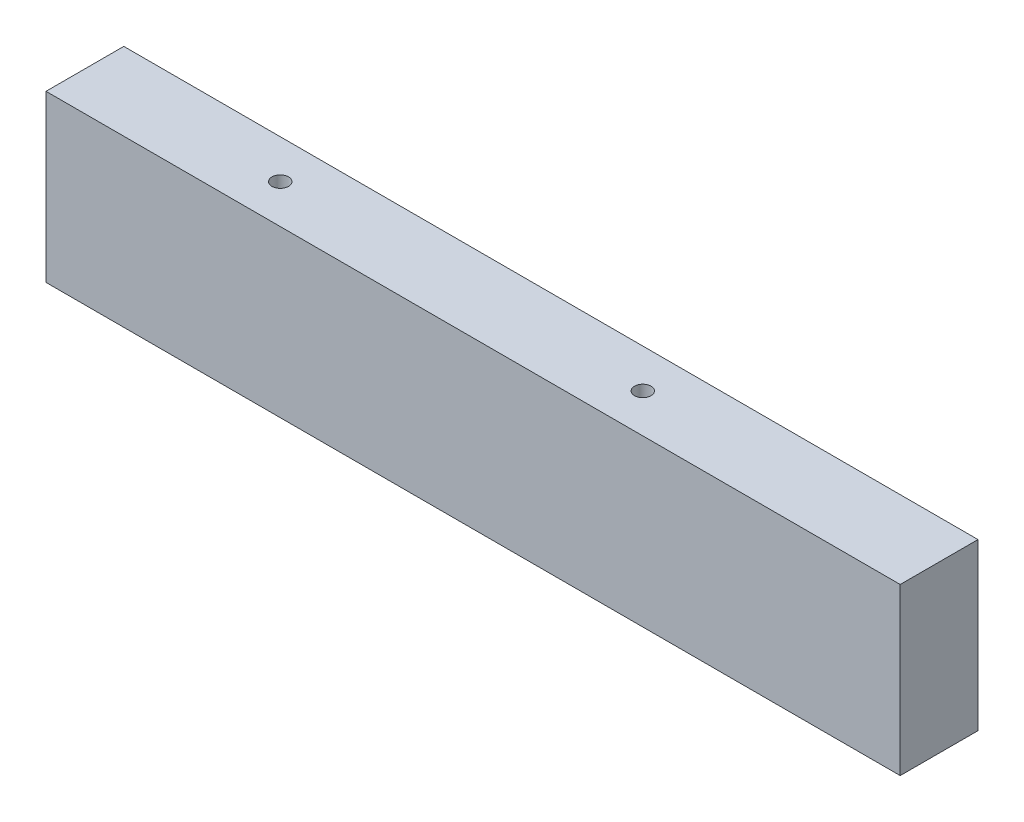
from build123d import *

# Parameters (mm, degrees)
SKETCH1_W           = 516
SKETCH1_H           = 47
BOSS_EXTRUDE1_DEPTH = 100
CUT_EXTRUDE1_REACH  = 529.698
SKETCH2_R           = 5


with BuildPart() as part:
    # Sketch1 → Boss-Extrude1 (new body)
    with BuildSketch(Plane(origin=(0, 0, 0), x_dir=(1, 0, 0), z_dir=(0, 1, 0))):
        with Locations((258, 23.5)):
            Rectangle(SKETCH1_W, SKETCH1_H)
    extrude(amount=BOSS_EXTRUDE1_DEPTH)

    # Sketch2 → Cut-Extrude1 (cut, up to next)
    with BuildSketch(Plane(origin=(0, 100, 0), x_dir=(1, 0, 0), z_dir=(0, 1, 0)), mode=Mode.PRIVATE) as cut_extrude1_sk1:
        with Locations(Location((337, 23.5, 0), (0, 0, 270))):
            Circle(SKETCH2_R)
    cut_extrude1_tool1 = extrude(cut_extrude1_sk1.sketch, amount=-CUT_EXTRUDE1_REACH, mode=Mode.PRIVATE) & part.part
    # Sketch2 → Cut-Extrude1 (cut, up to next)
    with BuildSketch(Plane(origin=(0, 100, 0), x_dir=(1, 0, 0), z_dir=(0, 1, 0)), mode=Mode.PRIVATE) as cut_extrude1_sk2:
        with Locations(Location((118, 23.5, 0), (0, 0, 270))):
            Circle(SKETCH2_R)
    cut_extrude1_tool2 = extrude(cut_extrude1_sk2.sketch, amount=-CUT_EXTRUDE1_REACH, mode=Mode.PRIVATE) & part.part
    add(cut_extrude1_tool1.solids().sort_by_distance((337, 100, -23.5))[0], mode=Mode.SUBTRACT)
    add(cut_extrude1_tool2.solids().sort_by_distance((118, 100, -23.5))[0], mode=Mode.SUBTRACT)


solid = part.part
